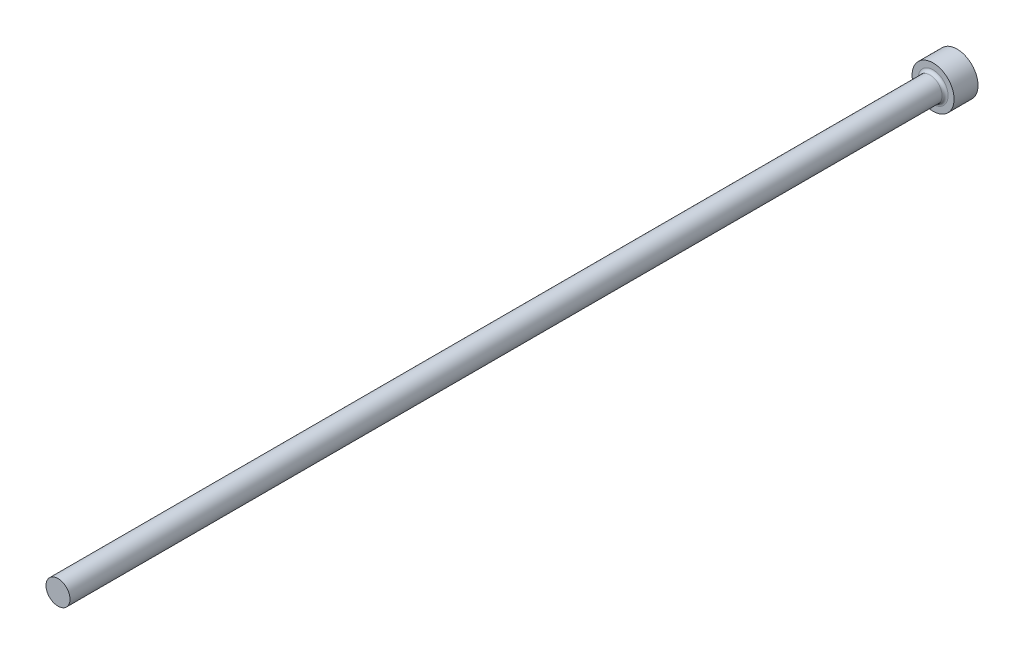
ISO-10303-21;
HEADER;
FILE_DESCRIPTION(('STEP AP214'),'2;1');
FILE_NAME('part.step','',(''),(''),'','','');
FILE_SCHEMA(('AUTOMOTIVE_DESIGN { 1 0 10303 214 1 1 1 1 }'));
ENDSEC;
DATA;
#1=APPLICATION_CONTEXT('core data for automotive mechanical design processes');
#2=APPLICATION_PROTOCOL_DEFINITION('international standard','automotive_design',2000,#1);
#3=PRODUCT_CONTEXT('',#1,'mechanical');
#4=PRODUCT('Part','Part','',(#3));
#5=PRODUCT_RELATED_PRODUCT_CATEGORY('part','',(#4));
#6=PRODUCT_DEFINITION_FORMATION('','',#4);
#7=PRODUCT_DEFINITION_CONTEXT('part definition',#1,'design');
#8=PRODUCT_DEFINITION('design','',#6,#7);
#9=PRODUCT_DEFINITION_SHAPE('','',#8);
#10=(LENGTH_UNIT() NAMED_UNIT(*) SI_UNIT(.MILLI.,.METRE.));
#11=(NAMED_UNIT(*) PLANE_ANGLE_UNIT() SI_UNIT($,.RADIAN.));
#12=(NAMED_UNIT(*) SI_UNIT($,.STERADIAN.) SOLID_ANGLE_UNIT());
#13=UNCERTAINTY_MEASURE_WITH_UNIT(LENGTH_MEASURE(1.E-05),#10,'distance_accuracy_value','');
#14=(GEOMETRIC_REPRESENTATION_CONTEXT(3) GLOBAL_UNCERTAINTY_ASSIGNED_CONTEXT((#13)) GLOBAL_UNIT_ASSIGNED_CONTEXT((#10,
#11,#12)) REPRESENTATION_CONTEXT('',''));
#15=CARTESIAN_POINT('',(0.,0.,0.));
#16=DIRECTION('',(0.,0.,1.));
#17=DIRECTION('',(1.,0.,0.));
#18=AXIS2_PLACEMENT_3D('',#15,#16,#17);
#19=CARTESIAN_POINT('',(3.5,0.,4.));
#20=DIRECTION('',(0.,0.,-1.));
#21=DIRECTION('',(-1.,0.,0.));
#22=AXIS2_PLACEMENT_3D('',#19,#20,#21);
#23=PLANE('',#22);
#24=CARTESIAN_POINT('',(0.,0.,4.));
#25=DIRECTION('',(0.,0.,-1.));
#26=DIRECTION('',(-1.,0.,0.));
#27=AXIS2_PLACEMENT_3D('',#24,#25,#26);
#28=CIRCLE('',#27,2.50000000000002);
#29=CARTESIAN_POINT('',(-2.50000000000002,0.,4.));
#30=VERTEX_POINT('',#29);
#31=EDGE_CURVE('E40',#30,#30,#28,.T.);
#32=ORIENTED_EDGE('',*,*,#31,.T.);
#33=EDGE_LOOP('',(#32));
#34=FACE_BOUND('',#33,.T.);
#35=CARTESIAN_POINT('',(0.,0.,4.));
#36=DIRECTION('',(0.,0.,-1.));
#37=DIRECTION('',(-1.,0.,0.));
#38=AXIS2_PLACEMENT_3D('',#35,#36,#37);
#39=CIRCLE('',#38,3.5);
#40=CARTESIAN_POINT('',(-3.5,0.,4.));
#41=VERTEX_POINT('',#40);
#42=EDGE_CURVE('E44',#41,#41,#39,.T.);
#43=ORIENTED_EDGE('',*,*,#42,.F.);
#44=EDGE_LOOP('',(#43));
#45=FACE_BOUND('',#44,.T.);
#46=ADVANCED_FACE('F33',(#34,#45),#23,.F.);
#47=CARTESIAN_POINT('',(0.,0.,-9.03322817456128));
#48=DIRECTION('',(0.,0.,-1.));
#49=DIRECTION('',(-1.,0.,0.));
#50=AXIS2_PLACEMENT_3D('',#47,#48,#49);
#51=CYLINDRICAL_SURFACE('',#50,3.5);
#52=CARTESIAN_POINT('',(0.,0.,0.));
#53=DIRECTION('',(0.,0.,-1.));
#54=DIRECTION('',(-1.,0.,0.));
#55=AXIS2_PLACEMENT_3D('',#52,#53,#54);
#56=CIRCLE('',#55,3.5);
#57=CARTESIAN_POINT('',(-3.5,0.,0.));
#58=VERTEX_POINT('',#57);
#59=EDGE_CURVE('E48',#58,#58,#56,.T.);
#60=ORIENTED_EDGE('',*,*,#59,.F.);
#61=EDGE_LOOP('',(#60));
#62=FACE_BOUND('',#61,.T.);
#63=ORIENTED_EDGE('',*,*,#42,.T.);
#64=EDGE_LOOP('',(#63));
#65=FACE_BOUND('',#64,.T.);
#66=ADVANCED_FACE('F68',(#62,#65),#51,.T.);
#67=CARTESIAN_POINT('',(0.,0.,0.));
#68=DIRECTION('',(0.,0.,1.));
#69=DIRECTION('',(1.,0.,0.));
#70=AXIS2_PLACEMENT_3D('',#67,#68,#69);
#71=PLANE('',#70);
#72=ORIENTED_EDGE('',*,*,#59,.T.);
#73=EDGE_LOOP('',(#72));
#74=FACE_BOUND('',#73,.T.);
#75=ADVANCED_FACE('F61',(#74),#71,.F.);
#76=CARTESIAN_POINT('',(0.,0.,150.));
#77=DIRECTION('',(0.,0.,-1.));
#78=DIRECTION('',(-1.,0.,0.));
#79=AXIS2_PLACEMENT_3D('',#76,#77,#78);
#80=PLANE('',#79);
#81=CARTESIAN_POINT('',(0.,0.,150.));
#82=DIRECTION('',(0.,0.,-1.));
#83=DIRECTION('',(-1.,0.,0.));
#84=AXIS2_PLACEMENT_3D('',#81,#82,#83);
#85=CIRCLE('',#84,2.00000000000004);
#86=CARTESIAN_POINT('',(-2.00000000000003,0.,150.));
#87=VERTEX_POINT('',#86);
#88=EDGE_CURVE('E53',#87,#87,#85,.T.);
#89=ORIENTED_EDGE('',*,*,#88,.F.);
#90=EDGE_LOOP('',(#89));
#91=FACE_BOUND('',#90,.T.);
#92=ADVANCED_FACE('F59',(#91),#80,.F.);
#93=CARTESIAN_POINT('',(0.,0.,-9.03322817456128));
#94=DIRECTION('',(0.,0.,-1.));
#95=DIRECTION('',(-1.,0.,0.));
#96=AXIS2_PLACEMENT_3D('',#93,#94,#95);
#97=CYLINDRICAL_SURFACE('',#96,2.00000000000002);
#98=CARTESIAN_POINT('',(0.,0.,4.5));
#99=DIRECTION('',(0.,0.,-1.));
#100=DIRECTION('',(-1.,0.,0.));
#101=AXIS2_PLACEMENT_3D('',#98,#99,#100);
#102=CIRCLE('',#101,2.00000000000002);
#103=CARTESIAN_POINT('',(-2.00000000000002,0.,4.5));
#104=VERTEX_POINT('',#103);
#105=EDGE_CURVE('E10',#104,#104,#102,.F.);
#106=ORIENTED_EDGE('',*,*,#105,.T.);
#107=EDGE_LOOP('',(#106));
#108=FACE_BOUND('',#107,.T.);
#109=ORIENTED_EDGE('',*,*,#88,.T.);
#110=EDGE_LOOP('',(#109));
#111=FACE_BOUND('',#110,.T.);
#112=ADVANCED_FACE('F57',(#108,#111),#97,.T.);
#113=CARTESIAN_POINT('',(0.,0.,4.5));
#114=DIRECTION('',(0.,0.,-1.));
#115=DIRECTION('',(-1.,0.,0.));
#116=AXIS2_PLACEMENT_3D('',#113,#114,#115);
#117=TOROIDAL_SURFACE('',#116,2.50000000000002,0.5);
#118=ORIENTED_EDGE('',*,*,#105,.F.);
#119=EDGE_LOOP('',(#118));
#120=FACE_BOUND('',#119,.T.);
#121=ORIENTED_EDGE('',*,*,#31,.F.);
#122=EDGE_LOOP('',(#121));
#123=FACE_BOUND('',#122,.T.);
#124=ADVANCED_FACE('F35',(#120,#123),#117,.F.);
#125=CLOSED_SHELL('',(#46,#66,#75,#92,#112,#124));
#126=MANIFOLD_SOLID_BREP('B2',#125);
#127=ADVANCED_BREP_SHAPE_REPRESENTATION('',(#18,#126),#14);
#128=SHAPE_DEFINITION_REPRESENTATION(#9,#127);
ENDSEC;
END-ISO-10303-21;
